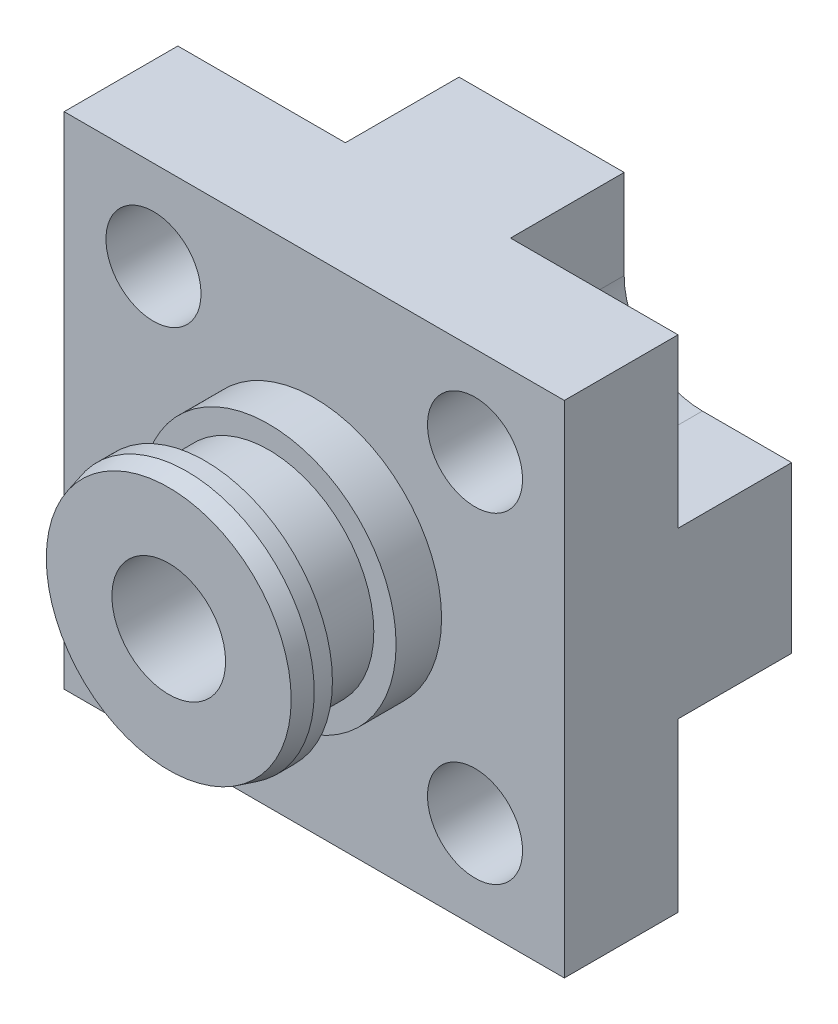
from build123d import *

# Parameters (mm, degrees)
SKETCH1_W          = 27.94
SKETCH1_H          = 27.94
BASE_DEPTH         = 12.7
SKETCH2_R          = 7.112
PLUG_DIA1_DEPTH    = 2.54
SKETCH3_R          = 5.8674
GROOVE_DIA_DEPTH   = 3.556
SKETCH4_R          = 7.112
PLUG_DIA2_DEPTH    = 2.032
SKETCH7_R          = 2.38125
BOTTOM_PORT_DEPTH  = 15.24
SKETCH8_R          = 3.175
BOTTOM_WELD_DEPTH  = 6.35
SKETCH12_R         = 2.6543
BOLT_CIRCLE_DEPTH  = 24.486417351
BOLT_CBORE_DEPTH   = 6.35
CHAMFER1_SIZE      = 1.016
CHAMFER1_SIZE2     = 0.27223638
SKETCH14_R         = 3.175
CENTER_CBORE_DEPTH = 17.018


with BuildPart() as part:
    # Sketch1 → base (new body)
    with BuildSketch(Plane.XY):
        Rectangle(SKETCH1_W, SKETCH1_H)
    extrude(amount=BASE_DEPTH)

    # Sketch2 → plug_dia1 (add)
    with BuildSketch(Plane.XY.offset(12.7)):
        Circle(SKETCH2_R)
    extrude(amount=PLUG_DIA1_DEPTH)

    # Sketch3 → groove_dia (add)
    with BuildSketch(Plane.XY.offset(15.24)):
        Circle(SKETCH3_R)
    extrude(amount=GROOVE_DIA_DEPTH)

    # Sketch4 → plug_dia2 (add)
    with BuildSketch(Plane.XY.offset(18.796)):
        Circle(SKETCH4_R)
    extrude(amount=PLUG_DIA2_DEPTH)

    # Sketch7 → bottom_port (cut)
    with BuildSketch(Plane.XZ.offset(13.97)):
        with Locations(Location((0, 6.35, 0), (0, 0, 270))):
            Circle(SKETCH7_R)
    extrude(amount=-BOTTOM_PORT_DEPTH, mode=Mode.SUBTRACT)

    # Sketch8 → bottom_weld (cut)
    with BuildSketch(Plane.XZ.offset(13.97)):
        with Locations(Location((0, 6.35, 0), (0, 0, 270))):
            Circle(SKETCH8_R)
    extrude(amount=-BOTTOM_WELD_DEPTH, mode=Mode.SUBTRACT)

    # Sketch12 → bolt_circle (cut, through all)
    with BuildSketch(Plane.XY.offset(12.7)):
        with Locations((8.980256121, 8.980256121)):
            Circle(SKETCH12_R)
        with Locations((8.980256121, -8.980256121)):
            Circle(SKETCH12_R)
        with Locations((-8.980256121, -8.980256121)):
            Circle(SKETCH12_R)
        with Locations((-8.980256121, 8.980256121)):
            Circle(SKETCH12_R)
    extrude(amount=-BOLT_CIRCLE_DEPTH, mode=Mode.SUBTRACT)

    # Sketch13 → bolt__cbore (cut)
    with BuildSketch(Plane(origin=(0, 0, 0), x_dir=(-1, 0, 0), z_dir=(0, 0, -1))):
        with BuildLine():
            Line((4.611456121, 8.980256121), (4.611456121, 17.962732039))
            Line((4.611456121, 17.962732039), (18.181467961, 17.962732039))
            Line((18.181467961, 17.962732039), (18.181467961, 4.611456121))
            Line((18.181467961, 4.611456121), (8.980256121, 4.611456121))
            ThreePointArc((8.980256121, 4.611456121), (5.891048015, 5.891048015), (4.611456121, 8.980256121))
        make_face()
        with BuildLine():
            Line((-8.980256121, 4.611456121), (-18.181467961, 4.611456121))
            Line((-18.181467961, 4.611456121), (-18.181467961, 17.962732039))
            Line((-18.181467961, 17.962732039), (-4.611456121, 17.962732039))
            Line((-4.611456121, 17.962732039), (-4.611456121, 8.980256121))
            ThreePointArc((-4.611456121, 8.980256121), (-5.891048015, 5.891048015), (-8.980256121, 4.611456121))
        make_face()
        with BuildLine():
            Line((-8.980256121, -4.611456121), (-18.181467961, -4.611456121))
            Line((-18.181467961, -4.611456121), (-18.181467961, -17.962732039))
            Line((-18.181467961, -17.962732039), (-4.611456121, -17.962732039))
            Line((-4.611456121, -17.962732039), (-4.611456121, -8.980256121))
            ThreePointArc((-4.611456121, -8.980256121), (-5.891048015, -5.891048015), (-8.980256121, -4.611456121))
        make_face()
        with BuildLine():
            Line((8.980256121, -4.611456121), (18.181467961, -4.611456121))
            Line((18.181467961, -4.611456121), (18.181467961, -17.962732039))
            Line((18.181467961, -17.962732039), (4.611456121, -17.962732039))
            Line((4.611456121, -17.962732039), (4.611456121, -8.980256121))
            ThreePointArc((4.611456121, -8.980256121), (5.891048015, -5.891048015), (8.980256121, -4.611456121))
        make_face()
    extrude(amount=-BOLT_CBORE_DEPTH, mode=Mode.SUBTRACT)

    # Chamfer1
    chamfer1_edges = [part.edges().sort_by_distance(p)[0] for p in [
        (-7.112, 0, 20.828),
    ]]
    chamfer1_side = [part.faces().sort_by_distance(p)[0] for p in [
        (-7.112, 0, 19.812),
    ]]
    chamfer(chamfer1_edges, length=CHAMFER1_SIZE, length2=CHAMFER1_SIZE2, reference=chamfer1_side[0])

    # Sketch14 → center_cbore (cut)
    with BuildSketch(Plane.XY.offset(20.828)):
        Circle(SKETCH14_R)
    extrude(amount=-CENTER_CBORE_DEPTH, mode=Mode.SUBTRACT)


solid = part.part
